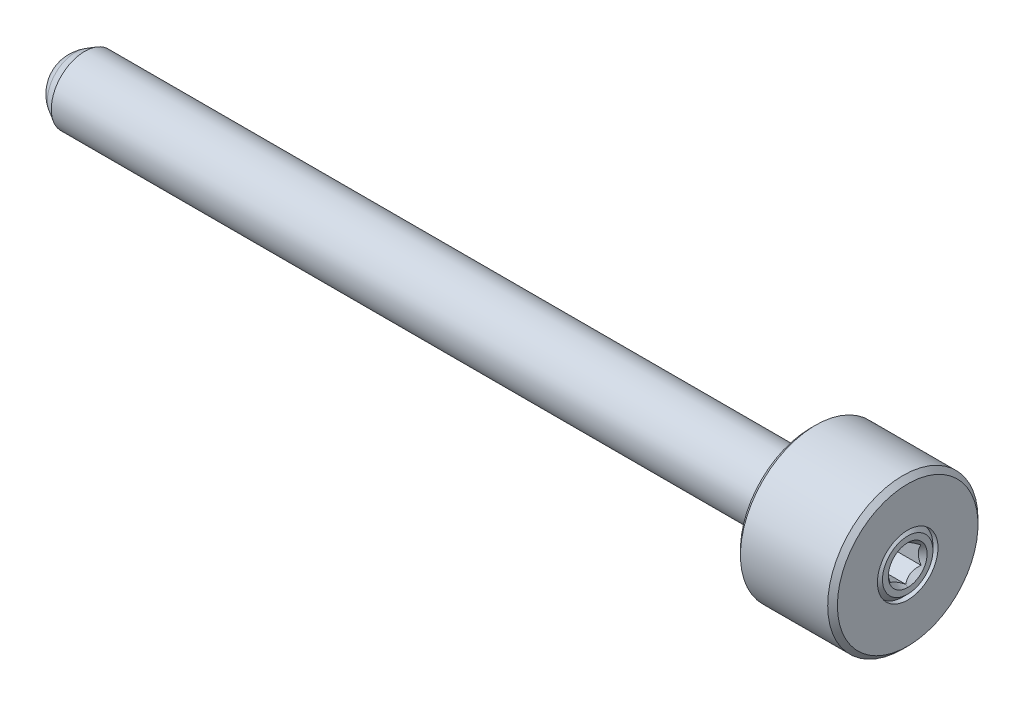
ISO-10303-21;
HEADER;
FILE_DESCRIPTION(('STEP AP214'),'2;1');
FILE_NAME('part.step','',(''),(''),'','','');
FILE_SCHEMA(('AUTOMOTIVE_DESIGN { 1 0 10303 214 1 1 1 1 }'));
ENDSEC;
DATA;
#1=APPLICATION_CONTEXT('core data for automotive mechanical design processes');
#2=APPLICATION_PROTOCOL_DEFINITION('international standard','automotive_design',2000,#1);
#3=PRODUCT_CONTEXT('',#1,'mechanical');
#4=PRODUCT('Part','Part','',(#3));
#5=PRODUCT_RELATED_PRODUCT_CATEGORY('part','',(#4));
#6=PRODUCT_DEFINITION_FORMATION('','',#4);
#7=PRODUCT_DEFINITION_CONTEXT('part definition',#1,'design');
#8=PRODUCT_DEFINITION('design','',#6,#7);
#9=PRODUCT_DEFINITION_SHAPE('','',#8);
#10=(LENGTH_UNIT() NAMED_UNIT(*) SI_UNIT(.MILLI.,.METRE.));
#11=(NAMED_UNIT(*) PLANE_ANGLE_UNIT() SI_UNIT($,.RADIAN.));
#12=(NAMED_UNIT(*) SI_UNIT($,.STERADIAN.) SOLID_ANGLE_UNIT());
#13=UNCERTAINTY_MEASURE_WITH_UNIT(LENGTH_MEASURE(1.E-05),#10,'distance_accuracy_value','');
#14=(GEOMETRIC_REPRESENTATION_CONTEXT(3) GLOBAL_UNCERTAINTY_ASSIGNED_CONTEXT((#13)) GLOBAL_UNIT_ASSIGNED_CONTEXT((#10,
#11,#12)) REPRESENTATION_CONTEXT('',''));
#15=CARTESIAN_POINT('',(0.,0.,0.));
#16=DIRECTION('',(0.,0.,1.));
#17=DIRECTION('',(1.,0.,0.));
#18=AXIS2_PLACEMENT_3D('',#15,#16,#17);
#19=CARTESIAN_POINT('',(24.3839999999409,-0.6858,-1.0668));
#20=DIRECTION('',(1.,0.,0.));
#21=DIRECTION('',(0.,0.,-1.));
#22=AXIS2_PLACEMENT_3D('',#19,#20,#21);
#23=CONICAL_SURFACE('',#22,0.800099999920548,1.02974425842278);
#24=CARTESIAN_POINT('',(23.9032514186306,-0.685800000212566,-1.0668));
#25=VERTEX_POINT('',#24);
#26=VERTEX_LOOP('',#25);
#27=FACE_BOUND('',#26,.T.);
#28=CARTESIAN_POINT('',(24.3840000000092,-0.6858,-1.0668));
#29=DIRECTION('',(1.,0.,0.));
#30=DIRECTION('',(0.,0.,-1.));
#31=AXIS2_PLACEMENT_3D('',#28,#29,#30);
#32=CIRCLE('',#31,0.800100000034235);
#33=CARTESIAN_POINT('',(24.3839999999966,0.00710692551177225,-1.46685000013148));
#34=VERTEX_POINT('',#33);
#35=CARTESIAN_POINT('',(24.3840000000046,-0.6858,-1.86690000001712));
#36=VERTEX_POINT('',#35);
#37=EDGE_CURVE('P0_E97',#34,#36,#32,.F.);
#38=ORIENTED_EDGE('',*,*,#37,.F.);
#39=CARTESIAN_POINT('',(24.3839999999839,-0.6858,-1.0668));
#40=DIRECTION('',(1.,0.,0.));
#41=DIRECTION('',(0.,0.,-1.));
#42=AXIS2_PLACEMENT_3D('',#39,#40,#41);
#43=CIRCLE('',#42,0.800099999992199);
#44=CARTESIAN_POINT('',(24.3840000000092,0.00710692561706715,-0.666750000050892));
#45=VERTEX_POINT('',#44);
#46=EDGE_CURVE('P0_E100',#45,#34,#43,.F.);
#47=ORIENTED_EDGE('',*,*,#46,.F.);
#48=CARTESIAN_POINT('',(24.3840000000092,-0.6858,-1.0668));
#49=DIRECTION('',(1.,0.,0.));
#50=DIRECTION('',(0.,0.,-1.));
#51=AXIS2_PLACEMENT_3D('',#48,#49,#50);
#52=CIRCLE('',#51,0.800100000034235);
#53=CARTESIAN_POINT('',(24.3840000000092,-0.685799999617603,-0.266699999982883));
#54=VERTEX_POINT('',#53);
#55=EDGE_CURVE('P0_E19',#54,#45,#52,.F.);
#56=ORIENTED_EDGE('',*,*,#55,.F.);
#57=CARTESIAN_POINT('',(24.3840000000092,-0.6858,-1.0668));
#58=DIRECTION('',(1.,0.,0.));
#59=DIRECTION('',(0.,0.,-1.));
#60=AXIS2_PLACEMENT_3D('',#57,#58,#59);
#61=CIRCLE('',#60,0.800100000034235);
#62=CARTESIAN_POINT('',(24.3840000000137,-1.37870692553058,-0.666749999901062));
#63=VERTEX_POINT('',#62);
#64=EDGE_CURVE('P0_E269',#63,#54,#61,.F.);
#65=ORIENTED_EDGE('',*,*,#64,.F.);
#66=CARTESIAN_POINT('',(24.3840000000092,-0.6858,-1.0668));
#67=DIRECTION('',(1.,0.,0.));
#68=DIRECTION('',(0.,0.,-1.));
#69=AXIS2_PLACEMENT_3D('',#66,#67,#68);
#70=CIRCLE('',#69,0.800100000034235);
#71=CARTESIAN_POINT('',(24.3840000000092,-1.3787069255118,-1.46685000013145));
#72=VERTEX_POINT('',#71);
#73=EDGE_CURVE('P0_E268',#72,#63,#70,.F.);
#74=ORIENTED_EDGE('',*,*,#73,.F.);
#75=CARTESIAN_POINT('',(24.3840000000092,-0.6858,-1.0668));
#76=DIRECTION('',(1.,0.,0.));
#77=DIRECTION('',(0.,0.,-1.));
#78=AXIS2_PLACEMENT_3D('',#75,#76,#77);
#79=CIRCLE('',#78,0.800100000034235);
#80=EDGE_CURVE('P0_E103',#36,#72,#79,.F.);
#81=ORIENTED_EDGE('',*,*,#80,.F.);
#82=EDGE_LOOP('',(#38,#47,#56,#65,#74,#81));
#83=FACE_BOUND('',#82,.T.);
#84=ADVANCED_FACE('P0_F16',(#27,#83),#23,.F.);
#85=CARTESIAN_POINT('',(24.384,-0.339346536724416,-0.46672499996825));
#86=DIRECTION('',(1.,0.,0.));
#87=DIRECTION('',(0.,0.,-1.));
#88=AXIS2_PLACEMENT_3D('',#85,#86,#87);
#89=PLANE('',#88);
#90=DIRECTION('',(0.,1.,0.));
#91=VECTOR('',#90,1.);
#92=CARTESIAN_POINT('',(24.384,-0.6858,-0.2667));
#93=LINE('',#92,#91);
#94=CARTESIAN_POINT('',(24.384,-0.223862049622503,-0.2667));
#95=VERTEX_POINT('',#94);
#96=EDGE_CURVE('P0_E170',#95,#54,#93,.F.);
#97=ORIENTED_EDGE('',*,*,#96,.T.);
#98=ORIENTED_EDGE('',*,*,#55,.T.);
#99=DIRECTION('',(0.,-0.499999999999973,0.866025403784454));
#100=VECTOR('',#99,1.);
#101=CARTESIAN_POINT('',(24.384,0.0071069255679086,-0.66675));
#102=LINE('',#101,#100);
#103=EDGE_CURVE('P0_E85',#45,#95,#102,.T.);
#104=ORIENTED_EDGE('',*,*,#103,.T.);
#105=EDGE_LOOP('',(#97,#98,#104));
#106=FACE_BOUND('',#105,.T.);
#107=ADVANCED_FACE('P0_F95',(#106),#89,.T.);
#108=CARTESIAN_POINT('',(24.384,-1.03225346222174,-0.466724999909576));
#109=DIRECTION('',(1.,0.,0.));
#110=DIRECTION('',(0.,0.,-1.));
#111=AXIS2_PLACEMENT_3D('',#108,#109,#110);
#112=PLANE('',#111);
#113=DIRECTION('',(0.,0.499999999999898,0.866025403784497));
#114=VECTOR('',#113,1.);
#115=CARTESIAN_POINT('',(24.384,-1.37870692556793,-0.66675));
#116=LINE('',#115,#114);
#117=CARTESIAN_POINT('',(24.384,-1.14773795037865,-0.266699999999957));
#118=VERTEX_POINT('',#117);
#119=EDGE_CURVE('P0_E160',#63,#118,#116,.T.);
#120=ORIENTED_EDGE('',*,*,#119,.F.);
#121=ORIENTED_EDGE('',*,*,#64,.T.);
#122=DIRECTION('',(0.,1.,0.));
#123=VECTOR('',#122,1.);
#124=CARTESIAN_POINT('',(24.384,-0.6858,-0.2667));
#125=LINE('',#124,#123);
#126=EDGE_CURVE('P0_E161',#54,#118,#125,.F.);
#127=ORIENTED_EDGE('',*,*,#126,.T.);
#128=EDGE_LOOP('',(#120,#121,#127));
#129=FACE_BOUND('',#128,.T.);
#130=ADVANCED_FACE('P0_F281',(#129),#112,.T.);
#131=CARTESIAN_POINT('',(24.384,-1.49419141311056,-1.06679999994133));
#132=DIRECTION('',(1.,0.,0.));
#133=DIRECTION('',(0.,0.,-1.));
#134=AXIS2_PLACEMENT_3D('',#131,#132,#133);
#135=PLANE('',#134);
#136=DIRECTION('',(0.,-0.499999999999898,0.866025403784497));
#137=VECTOR('',#136,1.);
#138=CARTESIAN_POINT('',(24.384,-1.37870692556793,-1.46685));
#139=LINE('',#138,#137);
#140=CARTESIAN_POINT('',(24.384,-1.6096759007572,-1.06679999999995));
#141=VERTEX_POINT('',#140);
#142=EDGE_CURVE('P0_E148',#72,#141,#139,.T.);
#143=ORIENTED_EDGE('',*,*,#142,.F.);
#144=ORIENTED_EDGE('',*,*,#73,.T.);
#145=DIRECTION('',(0.,0.499999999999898,0.866025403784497));
#146=VECTOR('',#145,1.);
#147=CARTESIAN_POINT('',(24.384,-1.37870692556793,-0.66675));
#148=LINE('',#147,#146);
#149=EDGE_CURVE('P0_E157',#141,#63,#148,.T.);
#150=ORIENTED_EDGE('',*,*,#149,.F.);
#151=EDGE_LOOP('',(#143,#144,#150));
#152=FACE_BOUND('',#151,.T.);
#153=ADVANCED_FACE('P0_F287',(#152),#135,.T.);
#154=CARTESIAN_POINT('',(24.384,-1.03225346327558,-1.66687500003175));
#155=DIRECTION('',(1.,0.,0.));
#156=DIRECTION('',(0.,0.,-1.));
#157=AXIS2_PLACEMENT_3D('',#154,#155,#156);
#158=PLANE('',#157);
#159=DIRECTION('',(0.,1.,0.));
#160=VECTOR('',#159,1.);
#161=CARTESIAN_POINT('',(24.384,-0.6858,-1.8669));
#162=LINE('',#161,#160);
#163=CARTESIAN_POINT('',(24.384,-1.14773795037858,-1.86690000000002));
#164=VERTEX_POINT('',#163);
#165=EDGE_CURVE('P0_E141',#36,#164,#162,.F.);
#166=ORIENTED_EDGE('',*,*,#165,.F.);
#167=ORIENTED_EDGE('',*,*,#80,.T.);
#168=DIRECTION('',(0.,-0.499999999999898,0.866025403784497));
#169=VECTOR('',#168,1.);
#170=CARTESIAN_POINT('',(24.384,-1.37870692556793,-1.46685));
#171=LINE('',#170,#169);
#172=EDGE_CURVE('P0_E145',#164,#72,#171,.T.);
#173=ORIENTED_EDGE('',*,*,#172,.F.);
#174=EDGE_LOOP('',(#166,#167,#173));
#175=FACE_BOUND('',#174,.T.);
#176=ADVANCED_FACE('P0_F293',(#175),#158,.T.);
#177=CARTESIAN_POINT('',(24.384,-0.339346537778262,-1.66687500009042));
#178=DIRECTION('',(1.,0.,0.));
#179=DIRECTION('',(0.,0.,-1.));
#180=AXIS2_PLACEMENT_3D('',#177,#178,#179);
#181=PLANE('',#180);
#182=DIRECTION('',(0.,0.499999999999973,0.866025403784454));
#183=VECTOR('',#182,1.);
#184=CARTESIAN_POINT('',(24.384,0.00710692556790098,-1.46685));
#185=LINE('',#184,#183);
#186=CARTESIAN_POINT('',(24.384,-0.223862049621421,-1.86689999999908));
#187=VERTEX_POINT('',#186);
#188=EDGE_CURVE('P0_E109',#187,#34,#185,.T.);
#189=ORIENTED_EDGE('',*,*,#188,.T.);
#190=ORIENTED_EDGE('',*,*,#37,.T.);
#191=DIRECTION('',(0.,1.,0.));
#192=VECTOR('',#191,1.);
#193=CARTESIAN_POINT('',(24.384,-0.6858,-1.8669));
#194=LINE('',#193,#192);
#195=EDGE_CURVE('P0_E112',#187,#36,#194,.F.);
#196=ORIENTED_EDGE('',*,*,#195,.F.);
#197=EDGE_LOOP('',(#189,#190,#196));
#198=FACE_BOUND('',#197,.T.);
#199=ADVANCED_FACE('P0_F110',(#198),#181,.T.);
#200=CARTESIAN_POINT('',(24.384,0.122591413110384,-1.06680000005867));
#201=DIRECTION('',(1.,0.,0.));
#202=DIRECTION('',(0.,0.,-1.));
#203=AXIS2_PLACEMENT_3D('',#200,#201,#202);
#204=PLANE('',#203);
#205=DIRECTION('',(0.,-0.499999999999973,0.866025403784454));
#206=VECTOR('',#205,1.);
#207=CARTESIAN_POINT('',(24.384,0.0071069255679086,-0.66675));
#208=LINE('',#207,#206);
#209=CARTESIAN_POINT('',(24.384,0.238075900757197,-1.0668));
#210=VERTEX_POINT('',#209);
#211=EDGE_CURVE('P0_E123',#210,#45,#208,.T.);
#212=ORIENTED_EDGE('',*,*,#211,.T.);
#213=ORIENTED_EDGE('',*,*,#46,.T.);
#214=DIRECTION('',(0.,0.499999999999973,0.866025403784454));
#215=VECTOR('',#214,1.);
#216=CARTESIAN_POINT('',(24.384,0.00710692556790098,-1.46685));
#217=LINE('',#216,#215);
#218=EDGE_CURVE('P0_E117',#34,#210,#217,.T.);
#219=ORIENTED_EDGE('',*,*,#218,.T.);
#220=EDGE_LOOP('',(#212,#213,#219));
#221=FACE_BOUND('',#220,.T.);
#222=ADVANCED_FACE('P0_F121',(#221),#204,.T.);
#223=CARTESIAN_POINT('',(25.3470116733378,0.0071069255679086,-0.66675));
#224=DIRECTION('',(0.,0.866025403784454,0.499999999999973));
#225=DIRECTION('',(0.,-0.499999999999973,0.866025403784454));
#226=AXIS2_PLACEMENT_3D('',#223,#224,#225);
#227=PLANE('',#226);
#228=ORIENTED_EDGE('',*,*,#103,.F.);
#229=ORIENTED_EDGE('',*,*,#211,.F.);
#230=DIRECTION('',(1.,0.,0.));
#231=VECTOR('',#230,1.);
#232=CARTESIAN_POINT('',(25.3470116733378,0.238075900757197,-1.0668));
#233=LINE('',#232,#231);
#234=CARTESIAN_POINT('',(26.3100233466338,0.238075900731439,-1.0668));
#235=VERTEX_POINT('',#234);
#236=EDGE_CURVE('P0_E128',#210,#235,#233,.T.);
#237=ORIENTED_EDGE('',*,*,#236,.T.);
#238=CARTESIAN_POINT('',(26.3100233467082,0.238075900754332,-1.06679999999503));
#239=CARTESIAN_POINT('',(26.2938101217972,0.223964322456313,-1.04235802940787));
#240=CARTESIAN_POINT('',(26.2783818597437,0.20959939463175,-1.01747724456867));
#241=CARTESIAN_POINT('',(26.2496570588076,0.180238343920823,-0.966622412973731));
#242=CARTESIAN_POINT('',(26.2363745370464,0.165238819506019,-0.94064247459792));
#243=CARTESIAN_POINT('',(26.2128787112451,0.134861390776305,-0.888027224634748));
#244=CARTESIAN_POINT('',(26.2026274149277,0.119491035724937,-0.861404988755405));
#245=CARTESIAN_POINT('',(26.1857517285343,0.0882957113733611,-0.807373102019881));
#246=CARTESIAN_POINT('',(26.1791177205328,0.0724720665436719,-0.779965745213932));
#247=CARTESIAN_POINT('',(26.168735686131,0.0355681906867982,-0.716046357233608));
#248=CARTESIAN_POINT('',(26.166508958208,0.0143720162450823,-0.679333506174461));
#249=CARTESIAN_POINT('',(26.1698658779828,-0.0278713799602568,-0.606165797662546));
#250=CARTESIAN_POINT('',(26.1754550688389,-0.0489184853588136,-0.569711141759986));
#251=CARTESIAN_POINT('',(26.1961554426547,-0.0967668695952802,-0.486835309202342));
#252=CARTESIAN_POINT('',(26.2137188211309,-0.123283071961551,-0.440907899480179));
#253=CARTESIAN_POINT('',(26.256811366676,-0.174802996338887,-0.351672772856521));
#254=CARTESIAN_POINT('',(26.2823687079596,-0.19980098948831,-0.308374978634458));
#255=CARTESIAN_POINT('',(26.3100233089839,-0.22386201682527,-0.266700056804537));
#256=B_SPLINE_CURVE_WITH_KNOTS('',3,(#238,#239,#240,#241,#242,#243,#244,#245,#246,#247,#248,
#249,#250,#251,#252,#253,#254,#255),.UNSPECIFIED.,.F.,.F.,(4,2,2,2,2,2,2,2,4),(0.,
0.0977059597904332,0.196026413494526,0.293056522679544,0.389827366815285,0.516446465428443,
0.643155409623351,0.809933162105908,0.977305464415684),.UNSPECIFIED.);
#257=CARTESIAN_POINT('',(26.3100233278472,-0.223862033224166,-0.266700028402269));
#258=VERTEX_POINT('',#257);
#259=EDGE_CURVE('P0_E130',#235,#258,#256,.T.);
#260=ORIENTED_EDGE('',*,*,#259,.T.);
#261=DIRECTION('',(1.,0.,0.));
#262=VECTOR('',#261,1.);
#263=CARTESIAN_POINT('',(25.3470116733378,-0.223862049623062,-0.2667));
#264=LINE('',#263,#262);
#265=EDGE_CURVE('P0_E178',#258,#95,#264,.F.);
#266=ORIENTED_EDGE('',*,*,#265,.T.);
#267=EDGE_LOOP('',(#228,#229,#237,#260,#266));
#268=FACE_BOUND('',#267,.T.);
#269=ADVANCED_FACE('P0_F254',(#268),#227,.F.);
#270=CARTESIAN_POINT('',(25.3470116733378,-0.6858,-0.2667));
#271=DIRECTION('',(0.,0.,1.));
#272=DIRECTION('',(1.,0.,0.));
#273=AXIS2_PLACEMENT_3D('',#270,#271,#272);
#274=PLANE('',#273);
#275=ORIENTED_EDGE('',*,*,#126,.F.);
#276=ORIENTED_EDGE('',*,*,#96,.F.);
#277=ORIENTED_EDGE('',*,*,#265,.F.);
#278=CARTESIAN_POINT('',(26.310023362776,-0.223862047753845,-0.266700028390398));
#279=CARTESIAN_POINT('',(26.2938101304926,-0.252085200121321,-0.266700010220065));
#280=CARTESIAN_POINT('',(26.2783818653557,-0.280815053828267,-0.266700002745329));
#281=CARTESIAN_POINT('',(26.2496570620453,-0.339537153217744,-0.266699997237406));
#282=CARTESIAN_POINT('',(26.2363745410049,-0.369536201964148,-0.266699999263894));
#283=CARTESIAN_POINT('',(26.2128787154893,-0.430291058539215,-0.266700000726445));
#284=CARTESIAN_POINT('',(26.2026274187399,-0.461031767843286,-0.266700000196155));
#285=CARTESIAN_POINT('',(26.1857517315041,-0.523422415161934,-0.266699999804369));
#286=CARTESIAN_POINT('',(26.1791177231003,-0.555069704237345,-0.26669999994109));
#287=CARTESIAN_POINT('',(26.1687356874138,-0.628877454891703,-0.26670000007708));
#288=CARTESIAN_POINT('',(26.1665089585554,-0.671269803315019,-0.266700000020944));
#289=CARTESIAN_POINT('',(26.1698658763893,-0.755756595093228,-0.266699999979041));
#290=CARTESIAN_POINT('',(26.1754550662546,-0.797850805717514,-0.266699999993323));
#291=CARTESIAN_POINT('',(26.196155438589,-0.893547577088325,-0.266700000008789));
#292=CARTESIAN_POINT('',(26.2137188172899,-0.946579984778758,-0.266700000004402));
#293=CARTESIAN_POINT('',(26.2568113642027,-1.04961983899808,-0.266699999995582));
#294=CARTESIAN_POINT('',(26.2823687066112,-1.09961582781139,-0.266699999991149));
#295=CARTESIAN_POINT('',(26.3100233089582,-1.14773788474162,-0.2667));
#296=B_SPLINE_CURVE_WITH_KNOTS('',3,(#278,#279,#280,#281,#282,#283,#284,#285,#286,#287,#288,
#289,#290,#291,#292,#293,#294,#295),.UNSPECIFIED.,.F.,.F.,(4,2,2,2,2,2,2,2,4),(0.,
0.0977059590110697,0.196026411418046,0.293056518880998,0.389827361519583,0.516446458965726,
0.643155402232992,0.809933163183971,0.977305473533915),.UNSPECIFIED.);
#297=CARTESIAN_POINT('',(26.3100233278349,-1.14773791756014,-0.266699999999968));
#298=VERTEX_POINT('',#297);
#299=EDGE_CURVE('P0_E258',#258,#298,#296,.T.);
#300=ORIENTED_EDGE('',*,*,#299,.T.);
#301=DIRECTION('',(1.,0.,0.));
#302=VECTOR('',#301,1.);
#303=CARTESIAN_POINT('',(25.3470116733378,-1.14773795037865,-0.266699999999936));
#304=LINE('',#303,#302);
#305=EDGE_CURVE('P0_E149',#118,#298,#304,.T.);
#306=ORIENTED_EDGE('',*,*,#305,.F.);
#307=EDGE_LOOP('',(#275,#276,#277,#300,#306));
#308=FACE_BOUND('',#307,.T.);
#309=ADVANCED_FACE('P0_F249',(#308),#274,.F.);
#310=CARTESIAN_POINT('',(25.3470116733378,-1.37870692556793,-0.66675));
#311=DIRECTION('',(0.,0.866025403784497,-0.499999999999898));
#312=DIRECTION('',(0.,0.499999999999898,0.866025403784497));
#313=AXIS2_PLACEMENT_3D('',#310,#311,#312);
#314=PLANE('',#313);
#315=ORIENTED_EDGE('',*,*,#305,.T.);
#316=CARTESIAN_POINT('',(26.3100233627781,-1.14773792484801,-0.266700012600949));
#317=CARTESIAN_POINT('',(26.293810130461,-1.16184951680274,-0.291141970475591));
#318=CARTESIAN_POINT('',(26.2783818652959,-1.17621445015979,-0.316022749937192));
#319=CARTESIAN_POINT('',(26.2496570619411,-1.205575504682,-0.366877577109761));
#320=CARTESIAN_POINT('',(26.2363745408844,-1.2205750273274,-0.392857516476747));
#321=CARTESIAN_POINT('',(26.2128787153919,-1.25095245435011,-0.445472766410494));
#322=CARTESIAN_POINT('',(26.2026274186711,-1.26632280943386,-0.4720950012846));
#323=CARTESIAN_POINT('',(26.1857517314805,-1.29751813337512,-0.526126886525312));
#324=CARTESIAN_POINT('',(26.1791177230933,-1.31334177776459,-0.55353424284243));
#325=CARTESIAN_POINT('',(26.1687356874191,-1.35024565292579,-0.61745362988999));
#326=CARTESIAN_POINT('',(26.1665089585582,-1.37144182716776,-0.654166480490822));
#327=CARTESIAN_POINT('',(26.1698658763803,-1.41368522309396,-0.727334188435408));
#328=CARTESIAN_POINT('',(26.1754550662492,-1.43473232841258,-0.763788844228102));
#329=CARTESIAN_POINT('',(26.1961554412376,-1.48258072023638,-0.846664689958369));
#330=CARTESIAN_POINT('',(26.2137188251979,-1.50909692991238,-0.892592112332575));
#331=CARTESIAN_POINT('',(26.2568113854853,-1.56061686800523,-0.981827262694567));
#332=CARTESIAN_POINT('',(26.2823687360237,-1.58561486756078,-1.0251250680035));
#333=CARTESIAN_POINT('',(26.3100233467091,-1.60967590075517,-1.06679999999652));
#334=B_SPLINE_CURVE_WITH_KNOTS('',3,(#316,#317,#318,#319,#320,#321,#322,#323,#324,#325,#326,
#327,#328,#329,#330,#331,#332,#333),.UNSPECIFIED.,.F.,.F.,(4,2,2,2,2,2,2,2,4),(0.,
0.0977059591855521,0.19602641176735,0.293056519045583,0.389827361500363,0.516446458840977,
0.643155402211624,0.80993320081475,0.977305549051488),.UNSPECIFIED.);
#335=CARTESIAN_POINT('',(26.3100233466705,-1.60967590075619,-1.06679999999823));
#336=VERTEX_POINT('',#335);
#337=EDGE_CURVE('P0_E233',#298,#336,#334,.T.);
#338=ORIENTED_EDGE('',*,*,#337,.T.);
#339=DIRECTION('',(1.,0.,0.));
#340=VECTOR('',#339,1.);
#341=CARTESIAN_POINT('',(25.3470116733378,-1.60967590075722,-1.06679999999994));
#342=LINE('',#341,#340);
#343=EDGE_CURVE('P0_E142',#141,#336,#342,.T.);
#344=ORIENTED_EDGE('',*,*,#343,.F.);
#345=ORIENTED_EDGE('',*,*,#149,.T.);
#346=ORIENTED_EDGE('',*,*,#119,.T.);
#347=EDGE_LOOP('',(#315,#338,#344,#345,#346));
#348=FACE_BOUND('',#347,.T.);
#349=ADVANCED_FACE('P0_F243',(#348),#314,.T.);
#350=CARTESIAN_POINT('',(25.3470116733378,-1.37870692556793,-1.46685));
#351=DIRECTION('',(0.,0.866025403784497,0.499999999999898));
#352=DIRECTION('',(0.,-0.499999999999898,0.866025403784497));
#353=AXIS2_PLACEMENT_3D('',#350,#351,#352);
#354=PLANE('',#353);
#355=ORIENTED_EDGE('',*,*,#343,.T.);
#356=CARTESIAN_POINT('',(26.3100233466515,-1.60967590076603,-1.06679999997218));
#357=CARTESIAN_POINT('',(26.2938101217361,-1.59556432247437,-1.09124197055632));
#358=CARTESIAN_POINT('',(26.2783818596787,-1.58119939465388,-1.11612275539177));
#359=CARTESIAN_POINT('',(26.2496570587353,-1.55183834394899,-1.16697758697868));
#360=CARTESIAN_POINT('',(26.2363745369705,-1.53683881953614,-1.19295752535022));
#361=CARTESIAN_POINT('',(26.2128787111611,-1.50646139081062,-1.2455727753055));
#362=CARTESIAN_POINT('',(26.2026274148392,-1.49109103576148,-1.27219501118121));
#363=CARTESIAN_POINT('',(26.1857517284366,-1.45989571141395,-1.32622689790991));
#364=CARTESIAN_POINT('',(26.1791177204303,-1.44407206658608,-1.35363425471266));
#365=CARTESIAN_POINT('',(26.1687356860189,-1.40716819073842,-1.41755364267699));
#366=CARTESIAN_POINT('',(26.1665089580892,-1.38597201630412,-1.45426649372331));
#367=CARTESIAN_POINT('',(26.1698658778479,-1.34372862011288,-1.52743420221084));
#368=CARTESIAN_POINT('',(26.1754550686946,-1.32268151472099,-1.56388885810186));
#369=CARTESIAN_POINT('',(26.1961554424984,-1.27483313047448,-1.64676469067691));
#370=CARTESIAN_POINT('',(26.2137188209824,-1.24831692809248,-1.69269210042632));
#371=CARTESIAN_POINT('',(26.2568113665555,-1.19679700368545,-1.78192722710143));
#372=CARTESIAN_POINT('',(26.2823687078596,-1.1717990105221,-1.82522502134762));
#373=CARTESIAN_POINT('',(26.3100233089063,-1.14773798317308,-1.86689994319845));
#374=B_SPLINE_CURVE_WITH_KNOTS('',3,(#356,#357,#358,#359,#360,#361,#362,#363,#364,#365,#366,
#367,#368,#369,#370,#371,#372,#373),.UNSPECIFIED.,.F.,.F.,(4,2,2,2,2,2,2,2,4),(0.,
0.0977059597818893,0.196026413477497,0.293056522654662,0.389827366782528,0.516446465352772,
0.643155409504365,0.809933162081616,0.977305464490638),.UNSPECIFIED.);
#375=CARTESIAN_POINT('',(26.3100233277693,-1.14773796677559,-1.8668999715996));
#376=VERTEX_POINT('',#375);
#377=EDGE_CURVE('P0_E226',#336,#376,#374,.T.);
#378=ORIENTED_EDGE('',*,*,#377,.T.);
#379=DIRECTION('',(1.,0.,0.));
#380=VECTOR('',#379,1.);
#381=CARTESIAN_POINT('',(25.3470116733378,-1.14773795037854,-1.8669));
#382=LINE('',#381,#380);
#383=EDGE_CURVE('P0_E154',#164,#376,#382,.T.);
#384=ORIENTED_EDGE('',*,*,#383,.F.);
#385=ORIENTED_EDGE('',*,*,#172,.T.);
#386=ORIENTED_EDGE('',*,*,#142,.T.);
#387=EDGE_LOOP('',(#355,#378,#384,#385,#386));
#388=FACE_BOUND('',#387,.T.);
#389=ADVANCED_FACE('P0_F239',(#388),#354,.T.);
#390=CARTESIAN_POINT('',(25.3470116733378,-0.6858,-1.8669));
#391=DIRECTION('',(0.,0.,1.));
#392=DIRECTION('',(1.,0.,0.));
#393=AXIS2_PLACEMENT_3D('',#390,#391,#392);
#394=PLANE('',#393);
#395=ORIENTED_EDGE('',*,*,#383,.T.);
#396=CARTESIAN_POINT('',(26.3100233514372,-1.14773795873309,-1.8669));
#397=CARTESIAN_POINT('',(26.2938101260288,-1.11951480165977,-1.8669));
#398=CARTESIAN_POINT('',(26.2783818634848,-1.09078494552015,-1.8669));
#399=CARTESIAN_POINT('',(26.2496570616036,-1.03206284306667,-1.8669));
#400=CARTESIAN_POINT('',(26.2363745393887,-1.00206379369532,-1.8669));
#401=CARTESIAN_POINT('',(26.212878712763,-0.941308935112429,-1.8669));
#402=CARTESIAN_POINT('',(26.2026274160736,-0.910568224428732,-1.8669));
#403=CARTESIAN_POINT('',(26.1857517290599,-0.848177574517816,-1.8669));
#404=CARTESIAN_POINT('',(26.1791177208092,-0.816530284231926,-1.8669));
#405=CARTESIAN_POINT('',(26.168735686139,-0.742722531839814,-1.8669));
#406=CARTESIAN_POINT('',(26.166508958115,-0.700330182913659,-1.8669));
#407=CARTESIAN_POINT('',(26.1698658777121,-0.615843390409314,-1.8669));
#408=CARTESIAN_POINT('',(26.1754550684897,-0.573749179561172,-1.8669));
#409=CARTESIAN_POINT('',(26.1961554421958,-0.478052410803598,-1.8669));
#410=CARTESIAN_POINT('',(26.213718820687,-0.425020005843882,-1.8669));
#411=CARTESIAN_POINT('',(26.2568113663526,-0.321980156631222,-1.8669));
#412=CARTESIAN_POINT('',(26.2823687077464,-0.271984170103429,-1.8669));
#413=CARTESIAN_POINT('',(26.3100233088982,-0.223862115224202,-1.8669));
#414=B_SPLINE_CURVE_WITH_KNOTS('',3,(#396,#397,#398,#399,#400,#401,#402,#403,#404,#405,#406,
#407,#408,#409,#410,#411,#412,#413),.UNSPECIFIED.,.F.,.F.,(4,2,2,2,2,2,2,2,4),(0.,
0.0977059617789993,0.196026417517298,0.293056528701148,0.38982737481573,0.516446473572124,
0.643155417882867,0.809933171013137,0.977305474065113),.UNSPECIFIED.);
#415=CARTESIAN_POINT('',(26.3100233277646,-0.223862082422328,-1.86689999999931));
#416=VERTEX_POINT('',#415);
#417=EDGE_CURVE('P0_E207',#376,#416,#414,.T.);
#418=ORIENTED_EDGE('',*,*,#417,.T.);
#419=DIRECTION('',(1.,0.,0.));
#420=VECTOR('',#419,1.);
#421=CARTESIAN_POINT('',(25.3470116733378,-0.2238620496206,-1.86689999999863));
#422=LINE('',#421,#420);
#423=EDGE_CURVE('P0_E118',#416,#187,#422,.F.);
#424=ORIENTED_EDGE('',*,*,#423,.T.);
#425=ORIENTED_EDGE('',*,*,#195,.T.);
#426=ORIENTED_EDGE('',*,*,#165,.T.);
#427=EDGE_LOOP('',(#395,#418,#424,#425,#426));
#428=FACE_BOUND('',#427,.T.);
#429=ADVANCED_FACE('P0_F242',(#428),#394,.T.);
#430=CARTESIAN_POINT('',(25.3470116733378,0.00710692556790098,-1.46685));
#431=DIRECTION('',(0.,0.866025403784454,-0.499999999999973));
#432=DIRECTION('',(0.,0.499999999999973,0.866025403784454));
#433=AXIS2_PLACEMENT_3D('',#430,#431,#432);
#434=PLANE('',#433);
#435=ORIENTED_EDGE('',*,*,#218,.F.);
#436=ORIENTED_EDGE('',*,*,#188,.F.);
#437=ORIENTED_EDGE('',*,*,#423,.F.);
#438=CARTESIAN_POINT('',(26.3100233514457,-0.223862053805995,-1.86690000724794));
#439=CARTESIAN_POINT('',(26.2938101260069,-0.20975047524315,-1.8424580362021));
#440=CARTESIAN_POINT('',(26.2783818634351,-0.195385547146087,-1.81757725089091));
#441=CARTESIAN_POINT('',(26.2496570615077,-0.166024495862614,-1.76672241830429));
#442=CARTESIAN_POINT('',(26.2363745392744,-0.151024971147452,-1.74074247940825));
#443=CARTESIAN_POINT('',(26.2128787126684,-0.120647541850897,-1.68812722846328));
#444=CARTESIAN_POINT('',(26.2026274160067,-0.105277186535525,-1.66150499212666));
#445=CARTESIAN_POINT('',(26.1857517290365,-0.0740818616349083,-1.60747310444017));
#446=CARTESIAN_POINT('',(26.1791177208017,-0.0582582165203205,-1.58006574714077));
#447=CARTESIAN_POINT('',(26.1687356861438,-0.0213543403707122,-1.51614635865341));
#448=CARTESIAN_POINT('',(26.1665089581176,-0.000158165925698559,-1.47943350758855));
#449=CARTESIAN_POINT('',(26.1698658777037,0.0420852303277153,-1.40626579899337));
#450=CARTESIAN_POINT('',(26.1754550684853,0.0631323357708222,-1.36981114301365));
#451=CARTESIAN_POINT('',(26.1961554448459,0.110980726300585,-1.28693529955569));
#452=CARTESIAN_POINT('',(26.2137188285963,0.137496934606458,-1.24100787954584));
#453=CARTESIAN_POINT('',(26.2568113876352,0.189016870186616,-1.15177273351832));
#454=CARTESIAN_POINT('',(26.2823687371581,0.214014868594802,-1.10847493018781));
#455=CARTESIAN_POINT('',(26.3100233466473,0.238075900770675,-1.06679999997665));
#456=B_SPLINE_CURVE_WITH_KNOTS('',3,(#438,#439,#440,#441,#442,#443,#444,#445,#446,#447,#448,
#449,#450,#451,#452,#453,#454,#455),.UNSPECIFIED.,.F.,.F.,(4,2,2,2,2,2,2,2,4),(0.,
0.0977059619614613,0.196026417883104,0.293056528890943,0.38982737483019,0.516446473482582,
0.643155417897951,0.80993320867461,0.977305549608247),.UNSPECIFIED.);
#457=EDGE_CURVE('P0_E200',#416,#235,#456,.T.);
#458=ORIENTED_EDGE('',*,*,#457,.T.);
#459=ORIENTED_EDGE('',*,*,#236,.F.);
#460=EDGE_LOOP('',(#435,#436,#437,#458,#459));
#461=FACE_BOUND('',#460,.T.);
#462=ADVANCED_FACE('P0_F126',(#461),#434,.F.);
#463=CARTESIAN_POINT('',(26.4159999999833,-0.6858,-1.0668));
#464=DIRECTION('',(1.,0.,0.));
#465=DIRECTION('',(0.,0.,-1.));
#466=AXIS2_PLACEMENT_3D('',#463,#464,#465);
#467=CONICAL_SURFACE('',#466,1.01599999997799,0.715584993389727);
#468=ORIENTED_EDGE('',*,*,#337,.F.);
#469=ORIENTED_EDGE('',*,*,#299,.F.);
#470=ORIENTED_EDGE('',*,*,#259,.F.);
#471=DIRECTION('',(-0.754709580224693,-0.656059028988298,0.));
#472=VECTOR('',#471,1.);
#473=CARTESIAN_POINT('',(499000.,433751.449289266,-1.06680000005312));
#474=LINE('',#473,#472);
#475=CARTESIAN_POINT('',(26.4159999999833,0.330199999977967,-1.0668));
#476=VERTEX_POINT('',#475);
#477=EDGE_CURVE('P0_E34',#235,#476,#474,.F.);
#478=ORIENTED_EDGE('',*,*,#477,.T.);
#479=CARTESIAN_POINT('',(26.4159999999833,-0.6858,-1.0668));
#480=DIRECTION('',(1.,0.,0.));
#481=DIRECTION('',(0.,0.,-1.));
#482=AXIS2_PLACEMENT_3D('',#479,#480,#481);
#483=CIRCLE('',#482,1.01599999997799);
#484=CARTESIAN_POINT('',(26.4159999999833,-1.7017999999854,-1.0668));
#485=VERTEX_POINT('',#484);
#486=EDGE_CURVE('P0_E197',#485,#476,#483,.F.);
#487=ORIENTED_EDGE('',*,*,#486,.F.);
#488=DIRECTION('',(-0.754709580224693,0.656059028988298,0.));
#489=VECTOR('',#488,1.);
#490=CARTESIAN_POINT('',(499000.,-433752.820889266,-1.0668));
#491=LINE('',#490,#489);
#492=EDGE_CURVE('P0_E232',#485,#336,#491,.T.);
#493=ORIENTED_EDGE('',*,*,#492,.T.);
#494=EDGE_LOOP('',(#468,#469,#470,#478,#487,#493));
#495=FACE_BOUND('',#494,.T.);
#496=ADVANCED_FACE('P0_F220',(#495),#467,.F.);
#497=CARTESIAN_POINT('',(26.4159999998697,-0.6858,-1.0668));
#498=DIRECTION('',(1.,0.,0.));
#499=DIRECTION('',(0.,0.,-1.));
#500=AXIS2_PLACEMENT_3D('',#497,#498,#499);
#501=CONICAL_SURFACE('',#500,1.01599999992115,0.715584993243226);
#502=ORIENTED_EDGE('',*,*,#457,.F.);
#503=ORIENTED_EDGE('',*,*,#417,.F.);
#504=ORIENTED_EDGE('',*,*,#377,.F.);
#505=ORIENTED_EDGE('',*,*,#492,.F.);
#506=CARTESIAN_POINT('',(26.4159999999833,-0.6858,-1.0668));
#507=DIRECTION('',(1.,0.,0.));
#508=DIRECTION('',(0.,0.,-1.));
#509=AXIS2_PLACEMENT_3D('',#506,#507,#508);
#510=CIRCLE('',#509,1.01600000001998);
#511=EDGE_CURVE('P0_E194',#476,#485,#510,.F.);
#512=ORIENTED_EDGE('',*,*,#511,.F.);
#513=ORIENTED_EDGE('',*,*,#477,.F.);
#514=EDGE_LOOP('',(#502,#503,#504,#505,#512,#513));
#515=FACE_BOUND('',#514,.T.);
#516=ADVANCED_FACE('P0_F215',(#515),#501,.F.);
#517=CARTESIAN_POINT('',(26.416,-0.6858,-1.06680000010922));
#518=DIRECTION('',(1.,0.,0.));
#519=DIRECTION('',(0.,0.,-1.));
#520=AXIS2_PLACEMENT_3D('',#517,#518,#519);
#521=PLANE('',#520);
#522=ORIENTED_EDGE('',*,*,#486,.T.);
#523=ORIENTED_EDGE('',*,*,#511,.T.);
#524=EDGE_LOOP('',(#522,#523));
#525=FACE_BOUND('',#524,.T.);
#526=CARTESIAN_POINT('',(26.4160000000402,-0.6858,-1.0668));
#527=DIRECTION('',(-1.,0.,0.));
#528=DIRECTION('',(0.,0.,1.));
#529=AXIS2_PLACEMENT_3D('',#526,#527,#528);
#530=CIRCLE('',#529,1.32079999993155);
#531=CARTESIAN_POINT('',(26.4160000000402,-0.6858,0.253999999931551));
#532=VERTEX_POINT('',#531);
#533=EDGE_CURVE('P0_E191',#532,#532,#530,.T.);
#534=ORIENTED_EDGE('',*,*,#533,.F.);
#535=EDGE_LOOP('',(#534));
#536=FACE_BOUND('',#535,.T.);
#537=ADVANCED_FACE('P0_F219',(#525,#536),#521,.T.);
#538=CARTESIAN_POINT('',(26.1619999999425,-0.6858,-1.0668));
#539=DIRECTION('',(-1.,0.,0.));
#540=DIRECTION('',(0.,0.,1.));
#541=AXIS2_PLACEMENT_3D('',#538,#539,#540);
#542=CONICAL_SURFACE('',#541,1.57480000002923,0.785398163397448);
#543=CARTESIAN_POINT('',(26.162,-0.6858,-1.0668));
#544=DIRECTION('',(1.,0.,0.));
#545=DIRECTION('',(0.,0.,-1.));
#546=AXIS2_PLACEMENT_3D('',#543,#544,#545);
#547=CIRCLE('',#546,1.5748);
#548=CARTESIAN_POINT('',(26.162,-0.6858,-2.6416));
#549=VERTEX_POINT('',#548);
#550=EDGE_CURVE('P0_E190',#549,#549,#547,.F.);
#551=ORIENTED_EDGE('',*,*,#550,.F.);
#552=EDGE_LOOP('',(#551));
#553=FACE_BOUND('',#552,.T.);
#554=ORIENTED_EDGE('',*,*,#533,.T.);
#555=EDGE_LOOP('',(#554));
#556=FACE_BOUND('',#555,.T.);
#557=ADVANCED_FACE('P0_F330',(#553,#556),#542,.T.);
#558=CARTESIAN_POINT('',(-16.3322,-0.6858,-1.0668));
#559=DIRECTION('',(0.,0.,1.));
#560=DIRECTION('',(0.,1.,0.));
#561=AXIS2_PLACEMENT_3D('',#558,#559,#560);
#562=SPHERICAL_SURFACE('',#561,1.70180000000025);
#563=CARTESIAN_POINT('',(-17.1831000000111,-0.6858,-1.0668));
#564=DIRECTION('',(1.,0.,0.));
#565=DIRECTION('',(0.,0.,-1.));
#566=AXIS2_PLACEMENT_3D('',#563,#564,#565);
#567=CIRCLE('',#566,1.47380203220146);
#568=CARTESIAN_POINT('',(-17.1831000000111,-0.6858,-2.54060203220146));
#569=VERTEX_POINT('',#568);
#570=EDGE_CURVE('P0_E187',#569,#569,#567,.T.);
#571=ORIENTED_EDGE('',*,*,#570,.F.);
#572=EDGE_LOOP('',(#571));
#573=FACE_BOUND('',#572,.T.);
#574=ADVANCED_FACE('P0_F326',(#573),#562,.T.);
#575=CARTESIAN_POINT('',(21.23948,-0.6858,-1.0668));
#576=DIRECTION('',(1.,0.,0.));
#577=DIRECTION('',(0.,0.,-1.));
#578=AXIS2_PLACEMENT_3D('',#575,#576,#577);
#579=CYLINDRICAL_SURFACE('',#578,1.5748);
#580=CARTESIAN_POINT('',(21.336,-0.6858,-1.0668));
#581=DIRECTION('',(1.,0.,0.));
#582=DIRECTION('',(0.,0.,-1.));
#583=AXIS2_PLACEMENT_3D('',#580,#581,#582);
#584=CIRCLE('',#583,1.5748);
#585=CARTESIAN_POINT('',(21.336,-0.6858,-2.6416));
#586=VERTEX_POINT('',#585);
#587=EDGE_CURVE('P0_E184',#586,#586,#584,.F.);
#588=ORIENTED_EDGE('',*,*,#587,.F.);
#589=EDGE_LOOP('',(#588));
#590=FACE_BOUND('',#589,.T.);
#591=ORIENTED_EDGE('',*,*,#550,.T.);
#592=EDGE_LOOP('',(#591));
#593=FACE_BOUND('',#592,.T.);
#594=ADVANCED_FACE('P0_F329',(#590,#593),#579,.T.);
#595=CARTESIAN_POINT('',(-16.7002077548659,-0.6858,-1.0668));
#596=DIRECTION('',(1.,0.,0.));
#597=DIRECTION('',(0.,0.,-1.));
#598=AXIS2_PLACEMENT_3D('',#595,#596,#597);
#599=CONICAL_SURFACE('',#598,1.75259999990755,0.523598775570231);
#600=ORIENTED_EDGE('',*,*,#570,.T.);
#601=EDGE_LOOP('',(#600));
#602=FACE_BOUND('',#601,.T.);
#603=CARTESIAN_POINT('',(-16.7002077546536,-0.6858,-1.0668));
#604=DIRECTION('',(-1.,0.,0.));
#605=DIRECTION('',(0.,0.,1.));
#606=AXIS2_PLACEMENT_3D('',#603,#604,#605);
#607=CIRCLE('',#606,1.7526);
#608=CARTESIAN_POINT('',(-16.7002077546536,-0.6858,0.6858));
#609=VERTEX_POINT('',#608);
#610=EDGE_CURVE('P0_E25',#609,#609,#607,.F.);
#611=ORIENTED_EDGE('',*,*,#610,.F.);
#612=EDGE_LOOP('',(#611));
#613=FACE_BOUND('',#612,.T.);
#614=ADVANCED_FACE('P0_F350',(#602,#613),#599,.T.);
#615=CARTESIAN_POINT('',(21.336,-0.685799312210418,-1.0668));
#616=DIRECTION('',(1.,0.,0.));
#617=DIRECTION('',(0.,0.,-1.));
#618=AXIS2_PLACEMENT_3D('',#615,#616,#617);
#619=PLANE('',#618);
#620=ORIENTED_EDGE('',*,*,#587,.T.);
#621=EDGE_LOOP('',(#620));
#622=FACE_BOUND('',#621,.T.);
#623=CARTESIAN_POINT('',(21.336,-0.6858,-1.0668));
#624=DIRECTION('',(-1.,0.,0.));
#625=DIRECTION('',(0.,0.,1.));
#626=AXIS2_PLACEMENT_3D('',#623,#624,#625);
#627=CIRCLE('',#626,1.7526);
#628=CARTESIAN_POINT('',(21.336,-0.6858,0.6858));
#629=VERTEX_POINT('',#628);
#630=EDGE_CURVE('P0_E11',#629,#629,#627,.T.);
#631=ORIENTED_EDGE('',*,*,#630,.F.);
#632=EDGE_LOOP('',(#631));
#633=FACE_BOUND('',#632,.T.);
#634=ADVANCED_FACE('P0_F344',(#622,#633),#619,.T.);
#635=CARTESIAN_POINT('',(22.0967241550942,-0.6858,-1.0668));
#636=DIRECTION('',(-1.,0.,0.));
#637=DIRECTION('',(0.,0.,1.));
#638=AXIS2_PLACEMENT_3D('',#635,#636,#637);
#639=CYLINDRICAL_SURFACE('',#638,1.7526);
#640=ORIENTED_EDGE('',*,*,#610,.T.);
#641=EDGE_LOOP('',(#640));
#642=FACE_BOUND('',#641,.T.);
#643=ORIENTED_EDGE('',*,*,#630,.T.);
#644=EDGE_LOOP('',(#643));
#645=FACE_BOUND('',#644,.T.);
#646=ADVANCED_FACE('P0_F342',(#642,#645),#639,.T.);
#647=CLOSED_SHELL('',(#84,#107,#130,#153,#176,#199,#222,#269,#309,#349,#389,#429,#462,#496,#516,
#537,#557,#574,#594,#614,#634,#646));
#648=MANIFOLD_SOLID_BREP('P0_B1',#647);
#649=CARTESIAN_POINT('',(21.2344,-0.6858,-1.0668));
#650=DIRECTION('',(1.,0.,0.));
#651=DIRECTION('',(0.,0.,-1.));
#652=AXIS2_PLACEMENT_3D('',#649,#650,#651);
#653=CYLINDRICAL_SURFACE('',#652,1.5875);
#654=CARTESIAN_POINT('',(26.416,-0.6858,-1.0668));
#655=DIRECTION('',(1.,0.,0.));
#656=DIRECTION('',(0.,0.,-1.));
#657=AXIS2_PLACEMENT_3D('',#654,#655,#656);
#658=CIRCLE('',#657,1.5875);
#659=CARTESIAN_POINT('',(26.416,-0.6858,-2.6543));
#660=VERTEX_POINT('',#659);
#661=EDGE_CURVE('P1_E17',#660,#660,#658,.F.);
#662=ORIENTED_EDGE('',*,*,#661,.F.);
#663=EDGE_LOOP('',(#662));
#664=FACE_BOUND('',#663,.T.);
#665=CARTESIAN_POINT('',(21.336,-0.6858,-1.0668));
#666=DIRECTION('',(1.,0.,0.));
#667=DIRECTION('',(0.,0.,-1.));
#668=AXIS2_PLACEMENT_3D('',#665,#666,#667);
#669=CIRCLE('',#668,1.5875);
#670=CARTESIAN_POINT('',(21.336,-0.6858,-2.6543));
#671=VERTEX_POINT('',#670);
#672=EDGE_CURVE('P1_E33',#671,#671,#669,.F.);
#673=ORIENTED_EDGE('',*,*,#672,.T.);
#674=EDGE_LOOP('',(#673));
#675=FACE_BOUND('',#674,.T.);
#676=ADVANCED_FACE('P1_F14',(#664,#675),#653,.F.);
#677=CARTESIAN_POINT('',(26.416,-0.6858,-1.0668));
#678=DIRECTION('',(1.,0.,0.));
#679=DIRECTION('',(0.,0.,-1.));
#680=AXIS2_PLACEMENT_3D('',#677,#678,#679);
#681=PLANE('',#680);
#682=ORIENTED_EDGE('',*,*,#661,.T.);
#683=EDGE_LOOP('',(#682));
#684=FACE_BOUND('',#683,.T.);
#685=CARTESIAN_POINT('',(26.4160000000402,-0.6858,-1.0668));
#686=DIRECTION('',(-1.,0.,0.));
#687=DIRECTION('',(0.,0.,1.));
#688=AXIS2_PLACEMENT_3D('',#685,#686,#687);
#689=CIRCLE('',#688,3.68300000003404);
#690=CARTESIAN_POINT('',(26.4160000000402,-0.6858,2.61620000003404));
#691=VERTEX_POINT('',#690);
#692=EDGE_CURVE('P1_E31',#691,#691,#689,.T.);
#693=ORIENTED_EDGE('',*,*,#692,.F.);
#694=EDGE_LOOP('',(#693));
#695=FACE_BOUND('',#694,.T.);
#696=ADVANCED_FACE('P1_F40',(#684,#695),#681,.T.);
#697=CARTESIAN_POINT('',(21.336,-0.6858,-1.0668));
#698=DIRECTION('',(1.,0.,0.));
#699=DIRECTION('',(0.,0.,-1.));
#700=AXIS2_PLACEMENT_3D('',#697,#698,#699);
#701=PLANE('',#700);
#702=ORIENTED_EDGE('',*,*,#672,.F.);
#703=EDGE_LOOP('',(#702));
#704=FACE_BOUND('',#703,.T.);
#705=CARTESIAN_POINT('',(21.3360000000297,-0.6858,-1.0668));
#706=DIRECTION('',(1.,0.,0.));
#707=DIRECTION('',(0.,0.,-1.));
#708=AXIS2_PLACEMENT_3D('',#705,#706,#707);
#709=CIRCLE('',#708,3.68300000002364);
#710=CARTESIAN_POINT('',(21.3360000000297,-0.6858,-4.74980000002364));
#711=VERTEX_POINT('',#710);
#712=EDGE_CURVE('P1_E26',#711,#711,#709,.T.);
#713=ORIENTED_EDGE('',*,*,#712,.F.);
#714=EDGE_LOOP('',(#713));
#715=FACE_BOUND('',#714,.T.);
#716=ADVANCED_FACE('P1_F48',(#704,#715),#701,.F.);
#717=CARTESIAN_POINT('',(26.1620000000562,-0.6858,-1.0668));
#718=DIRECTION('',(-1.,0.,0.));
#719=DIRECTION('',(0.,0.,1.));
#720=AXIS2_PLACEMENT_3D('',#717,#718,#719);
#721=CONICAL_SURFACE('',#720,3.93700000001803,0.785398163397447);
#722=CARTESIAN_POINT('',(26.162,-0.6858,-1.0668));
#723=DIRECTION('',(1.,0.,0.));
#724=DIRECTION('',(0.,0.,-1.));
#725=AXIS2_PLACEMENT_3D('',#722,#723,#724);
#726=CIRCLE('',#725,3.937);
#727=CARTESIAN_POINT('',(26.162,-0.6858,-5.0038));
#728=VERTEX_POINT('',#727);
#729=EDGE_CURVE('P1_E21',#728,#728,#726,.F.);
#730=ORIENTED_EDGE('',*,*,#729,.F.);
#731=EDGE_LOOP('',(#730));
#732=FACE_BOUND('',#731,.T.);
#733=ORIENTED_EDGE('',*,*,#692,.T.);
#734=EDGE_LOOP('',(#733));
#735=FACE_BOUND('',#734,.T.);
#736=ADVANCED_FACE('P1_F57',(#732,#735),#721,.T.);
#737=CARTESIAN_POINT('',(21.5900000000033,-0.6858,-1.0668));
#738=DIRECTION('',(1.,0.,0.));
#739=DIRECTION('',(0.,0.,-1.));
#740=AXIS2_PLACEMENT_3D('',#737,#738,#739);
#741=CONICAL_SURFACE('',#740,3.93699999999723,0.785398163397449);
#742=CARTESIAN_POINT('',(21.59,-0.6858,-1.0668));
#743=DIRECTION('',(1.,0.,0.));
#744=DIRECTION('',(0.,0.,-1.));
#745=AXIS2_PLACEMENT_3D('',#742,#743,#744);
#746=CIRCLE('',#745,3.937);
#747=CARTESIAN_POINT('',(21.59,-0.6858,-5.0038));
#748=VERTEX_POINT('',#747);
#749=EDGE_CURVE('P1_E10',#748,#748,#746,.T.);
#750=ORIENTED_EDGE('',*,*,#749,.F.);
#751=EDGE_LOOP('',(#750));
#752=FACE_BOUND('',#751,.T.);
#753=ORIENTED_EDGE('',*,*,#712,.T.);
#754=EDGE_LOOP('',(#753));
#755=FACE_BOUND('',#754,.T.);
#756=ADVANCED_FACE('P1_F51',(#752,#755),#741,.T.);
#757=CARTESIAN_POINT('',(21.49856,-0.6858,-1.0668));
#758=DIRECTION('',(1.,0.,0.));
#759=DIRECTION('',(0.,0.,-1.));
#760=AXIS2_PLACEMENT_3D('',#757,#758,#759);
#761=CYLINDRICAL_SURFACE('',#760,3.937);
#762=ORIENTED_EDGE('',*,*,#729,.T.);
#763=EDGE_LOOP('',(#762));
#764=FACE_BOUND('',#763,.T.);
#765=ORIENTED_EDGE('',*,*,#749,.T.);
#766=EDGE_LOOP('',(#765));
#767=FACE_BOUND('',#766,.T.);
#768=ADVANCED_FACE('P1_F49',(#764,#767),#761,.T.);
#769=CLOSED_SHELL('',(#676,#696,#716,#736,#756,#768));
#770=MANIFOLD_SOLID_BREP('P1_B1',#769);
#771=ADVANCED_BREP_SHAPE_REPRESENTATION('',(#18,#648,#770),#14);
#772=SHAPE_DEFINITION_REPRESENTATION(#9,#771);
ENDSEC;
END-ISO-10303-21;
